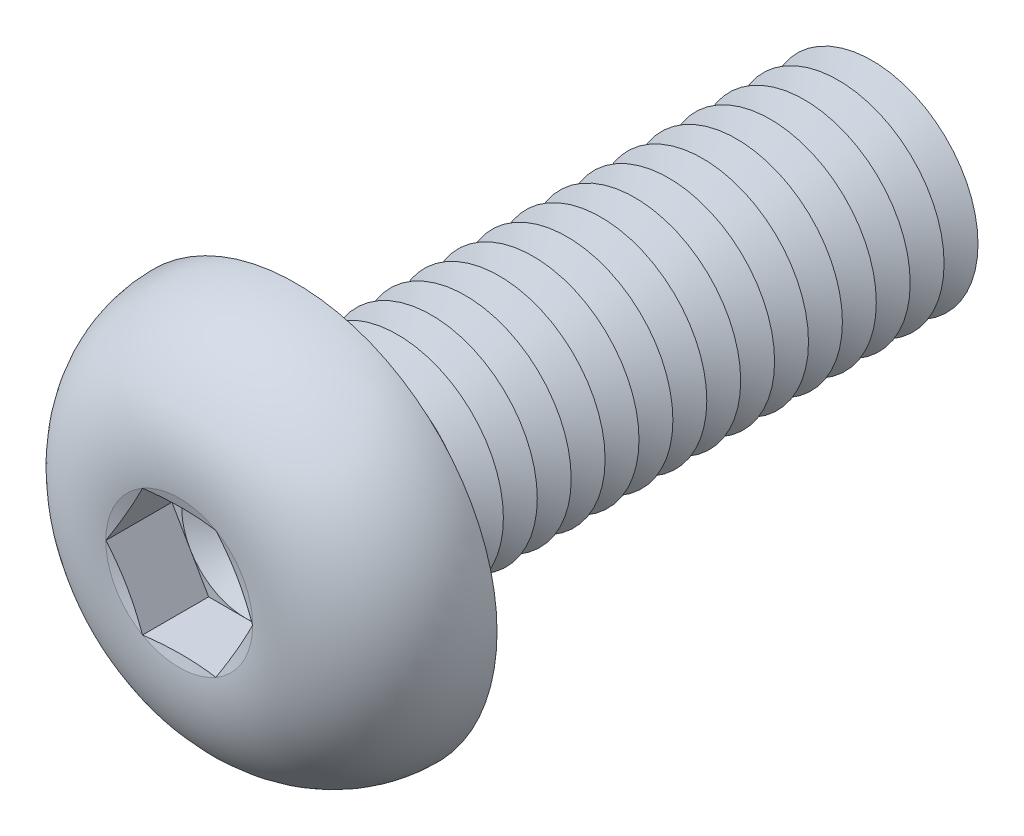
from build123d import *

# Parameters (mm, degrees)
FILLET1_R          = 0.4
LPATTERN1_COUNT    = 17
LPATTERN1_PITCH    = 0.8
CUT_EXTRUDE1_DEPTH = 1.56


with BuildPart() as part:
    # Sketch1 → Revolve1 (revolve)
    with BuildSketch(Plane(origin=(0, 0, 0), x_dir=(0, 0, -1), z_dir=(1, 0, 0)), mode=Mode.PRIVATE) as revolve1_sk:
        with BuildLine():
            Line((0, 2.5), (0, 4.75))
            ThreePointArc((0, 4.75), (-2.041477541, 3.848329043), (-2.75, 1.73205))
            Line((-2.75, 1.73205), (-2.517949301, 0.866025))
            Line((-2.517949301, 0.866025), (-2.75, 0.866025))
            Line((-2.75, 0.866025), (-2.75, 0))
            Line((-2.75, 0), (14, 0))
            Line((14, 0), (14, 2.5))
            Line((14, 2.5), (0, 2.5))
        make_face()
    revolve(revolve1_sk.sketch.rotate(Axis((0, 0, -14), (0, 0, 1)), 90), axis=Axis((0, 0, -14), (0, 0, 1)))

    # Fillet1
    fillet1_edges = [part.edges().sort_by_distance(p)[0] for p in [
        (2.5, 0, 0),
    ]]
    fillet(fillet1_edges, radius=FILLET1_R)

    # Sketch2 → Cut-Revolve1 (revolve, cut)
    with BuildSketch(Plane(origin=(0, 0, 0), x_dir=(0, 0, -1), z_dir=(1, 0, 0)), mode=Mode.PRIVATE) as cut_revolve1_sk:
        Polygon((13.6, 2.5), (14.4, 2.5), (14, 1.807179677), align=None)
    cut_revolve1 = revolve(cut_revolve1_sk.sketch.rotate(Axis((0, 0, -14), (0, 0, -1)), 270), axis=Axis((0, 0, -14), (0, 0, -1)), mode=Mode.SUBTRACT)

    # LPattern1: Cut-Revolve1 ×17
    with Locations(*[(0, 0, i * LPATTERN1_PITCH) for i in range(1, LPATTERN1_COUNT)]):
        add(cut_revolve1, mode=Mode.SUBTRACT)

    # Sketch3 → Cut-Extrude1 (cut)
    with BuildSketch(Plane.XY.offset(2.75)):
        Polygon((0.866025, 1.499999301), (-0.866025, 1.499999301), (-1.73205, 0), (-0.866025, -1.499999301), (0.866025, -1.499999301), (1.73205, 0), align=None)
    extrude(amount=-CUT_EXTRUDE1_DEPTH, mode=Mode.SUBTRACT)

    # Cut-Extrude2 cone 1 section (on through the dimple's axis) → Cut-Extrude2 (revolve, cut)
    with BuildSketch(Plane(origin=(0, 0, 1.19), x_dir=(0, -1, 0), z_dir=(1, 0, 0))):
        Polygon((0, 0), (1.499999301, 0), (0, 0.866025), align=None)
    revolve(axis=Axis((0, 0, 1.19), (0, 0, -1)), mode=Mode.SUBTRACT)


solid = part.part
